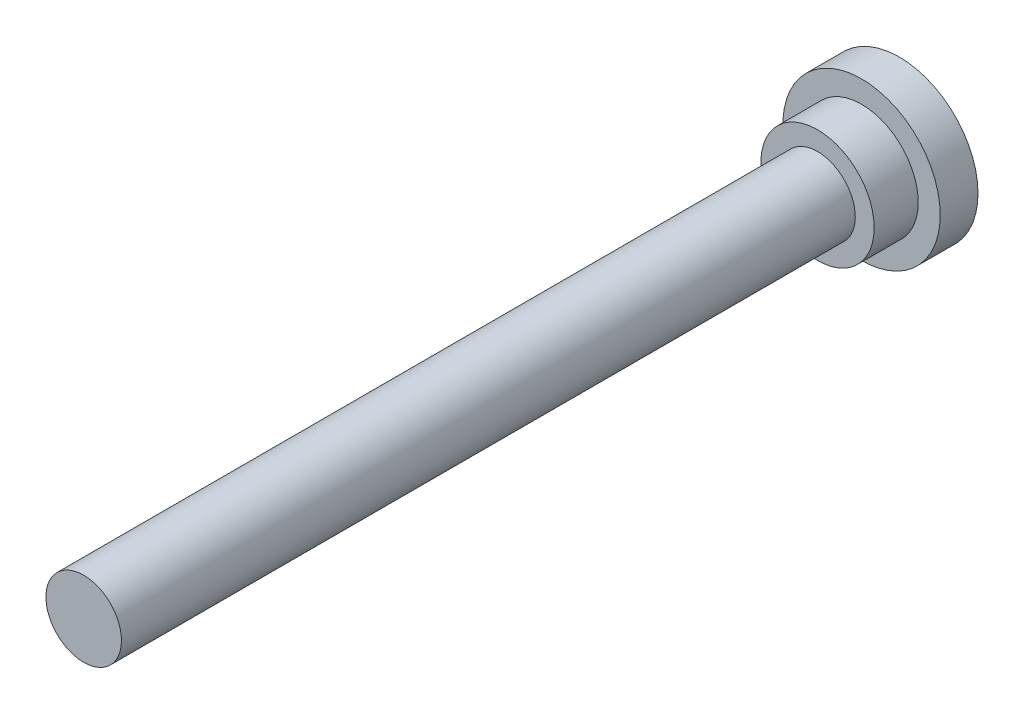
ISO-10303-21;
HEADER;
FILE_DESCRIPTION(('STEP AP214'),'2;1');
FILE_NAME('part.step','',(''),(''),'','','');
FILE_SCHEMA(('AUTOMOTIVE_DESIGN { 1 0 10303 214 1 1 1 1 }'));
ENDSEC;
DATA;
#1=APPLICATION_CONTEXT('core data for automotive mechanical design processes');
#2=APPLICATION_PROTOCOL_DEFINITION('international standard','automotive_design',2000,#1);
#3=PRODUCT_CONTEXT('',#1,'mechanical');
#4=PRODUCT('Part','Part','',(#3));
#5=PRODUCT_RELATED_PRODUCT_CATEGORY('part','',(#4));
#6=PRODUCT_DEFINITION_FORMATION('','',#4);
#7=PRODUCT_DEFINITION_CONTEXT('part definition',#1,'design');
#8=PRODUCT_DEFINITION('design','',#6,#7);
#9=PRODUCT_DEFINITION_SHAPE('','',#8);
#10=(LENGTH_UNIT() NAMED_UNIT(*) SI_UNIT(.MILLI.,.METRE.));
#11=(NAMED_UNIT(*) PLANE_ANGLE_UNIT() SI_UNIT($,.RADIAN.));
#12=(NAMED_UNIT(*) SI_UNIT($,.STERADIAN.) SOLID_ANGLE_UNIT());
#13=UNCERTAINTY_MEASURE_WITH_UNIT(LENGTH_MEASURE(1.E-05),#10,'distance_accuracy_value','');
#14=(GEOMETRIC_REPRESENTATION_CONTEXT(3) GLOBAL_UNCERTAINTY_ASSIGNED_CONTEXT((#13)) GLOBAL_UNIT_ASSIGNED_CONTEXT((#10,
#11,#12)) REPRESENTATION_CONTEXT('',''));
#15=CARTESIAN_POINT('',(0.,0.,0.));
#16=DIRECTION('',(0.,0.,1.));
#17=DIRECTION('',(1.,0.,0.));
#18=AXIS2_PLACEMENT_3D('',#15,#16,#17);
#19=CARTESIAN_POINT('',(0.,0.,129.6));
#20=DIRECTION('',(0.,0.,1.));
#21=DIRECTION('',(1.,0.,0.));
#22=AXIS2_PLACEMENT_3D('',#19,#20,#21);
#23=PLANE('',#22);
#24=CARTESIAN_POINT('',(0.,0.,129.6));
#25=DIRECTION('',(0.,0.,1.));
#26=DIRECTION('',(1.,0.,0.));
#27=AXIS2_PLACEMENT_3D('',#24,#25,#26);
#28=CIRCLE('',#27,6.);
#29=CARTESIAN_POINT('',(6.,0.,129.6));
#30=VERTEX_POINT('',#29);
#31=EDGE_CURVE('E8',#30,#30,#28,.T.);
#32=ORIENTED_EDGE('',*,*,#31,.T.);
#33=EDGE_LOOP('',(#32));
#34=FACE_BOUND('',#33,.T.);
#35=ADVANCED_FACE('F12',(#34),#23,.T.);
#36=CARTESIAN_POINT('',(0.,0.,30.));
#37=DIRECTION('',(0.,0.,1.));
#38=DIRECTION('',(1.,0.,0.));
#39=AXIS2_PLACEMENT_3D('',#36,#37,#38);
#40=CYLINDRICAL_SURFACE('',#39,6.);
#41=CARTESIAN_POINT('',(0.,0.,13.));
#42=DIRECTION('',(0.,0.,1.));
#43=DIRECTION('',(1.,0.,0.));
#44=AXIS2_PLACEMENT_3D('',#41,#42,#43);
#45=CIRCLE('',#44,6.);
#46=CARTESIAN_POINT('',(6.,0.,13.));
#47=VERTEX_POINT('',#46);
#48=EDGE_CURVE('E18',#47,#47,#45,.T.);
#49=ORIENTED_EDGE('',*,*,#48,.T.);
#50=EDGE_LOOP('',(#49));
#51=FACE_BOUND('',#50,.T.);
#52=ORIENTED_EDGE('',*,*,#31,.F.);
#53=EDGE_LOOP('',(#52));
#54=FACE_BOUND('',#53,.T.);
#55=ADVANCED_FACE('F52',(#51,#54),#40,.T.);
#56=CARTESIAN_POINT('',(-6.,0.,13.));
#57=DIRECTION('',(0.,0.,1.));
#58=DIRECTION('',(1.,0.,0.));
#59=AXIS2_PLACEMENT_3D('',#56,#57,#58);
#60=PLANE('',#59);
#61=CARTESIAN_POINT('',(0.,0.,13.));
#62=DIRECTION('',(0.,0.,1.));
#63=DIRECTION('',(1.,0.,0.));
#64=AXIS2_PLACEMENT_3D('',#61,#62,#63);
#65=CIRCLE('',#64,9.);
#66=CARTESIAN_POINT('',(9.,0.,13.));
#67=VERTEX_POINT('',#66);
#68=EDGE_CURVE('E22',#67,#67,#65,.T.);
#69=ORIENTED_EDGE('',*,*,#68,.T.);
#70=EDGE_LOOP('',(#69));
#71=FACE_BOUND('',#70,.T.);
#72=ORIENTED_EDGE('',*,*,#48,.F.);
#73=EDGE_LOOP('',(#72));
#74=FACE_BOUND('',#73,.T.);
#75=ADVANCED_FACE('F57',(#71,#74),#60,.T.);
#76=CARTESIAN_POINT('',(0.,0.,30.));
#77=DIRECTION('',(0.,0.,1.));
#78=DIRECTION('',(1.,0.,0.));
#79=AXIS2_PLACEMENT_3D('',#76,#77,#78);
#80=CYLINDRICAL_SURFACE('',#79,9.);
#81=CARTESIAN_POINT('',(0.,0.,6.));
#82=DIRECTION('',(0.,0.,1.));
#83=DIRECTION('',(1.,0.,0.));
#84=AXIS2_PLACEMENT_3D('',#81,#82,#83);
#85=CIRCLE('',#84,9.);
#86=CARTESIAN_POINT('',(9.,0.,6.));
#87=VERTEX_POINT('',#86);
#88=EDGE_CURVE('E26',#87,#87,#85,.T.);
#89=ORIENTED_EDGE('',*,*,#88,.T.);
#90=EDGE_LOOP('',(#89));
#91=FACE_BOUND('',#90,.T.);
#92=ORIENTED_EDGE('',*,*,#68,.F.);
#93=EDGE_LOOP('',(#92));
#94=FACE_BOUND('',#93,.T.);
#95=ADVANCED_FACE('F62',(#91,#94),#80,.T.);
#96=CARTESIAN_POINT('',(-9.,0.,6.));
#97=DIRECTION('',(0.,0.,1.));
#98=DIRECTION('',(1.,0.,0.));
#99=AXIS2_PLACEMENT_3D('',#96,#97,#98);
#100=PLANE('',#99);
#101=CARTESIAN_POINT('',(0.,0.,6.));
#102=DIRECTION('',(0.,0.,1.));
#103=DIRECTION('',(1.,0.,0.));
#104=AXIS2_PLACEMENT_3D('',#101,#102,#103);
#105=CIRCLE('',#104,12.5);
#106=CARTESIAN_POINT('',(12.5,0.,6.));
#107=VERTEX_POINT('',#106);
#108=EDGE_CURVE('E31',#107,#107,#105,.T.);
#109=ORIENTED_EDGE('',*,*,#108,.T.);
#110=EDGE_LOOP('',(#109));
#111=FACE_BOUND('',#110,.T.);
#112=ORIENTED_EDGE('',*,*,#88,.F.);
#113=EDGE_LOOP('',(#112));
#114=FACE_BOUND('',#113,.T.);
#115=ADVANCED_FACE('F49',(#111,#114),#100,.T.);
#116=CARTESIAN_POINT('',(0.,0.,30.));
#117=DIRECTION('',(0.,0.,1.));
#118=DIRECTION('',(1.,0.,0.));
#119=AXIS2_PLACEMENT_3D('',#116,#117,#118);
#120=CYLINDRICAL_SURFACE('',#119,12.5);
#121=CARTESIAN_POINT('',(0.,0.,0.));
#122=DIRECTION('',(0.,0.,1.));
#123=DIRECTION('',(1.,0.,0.));
#124=AXIS2_PLACEMENT_3D('',#121,#122,#123);
#125=CIRCLE('',#124,12.5);
#126=CARTESIAN_POINT('',(12.5,0.,0.));
#127=VERTEX_POINT('',#126);
#128=EDGE_CURVE('E34',#127,#127,#125,.T.);
#129=ORIENTED_EDGE('',*,*,#128,.T.);
#130=EDGE_LOOP('',(#129));
#131=FACE_BOUND('',#130,.T.);
#132=ORIENTED_EDGE('',*,*,#108,.F.);
#133=EDGE_LOOP('',(#132));
#134=FACE_BOUND('',#133,.T.);
#135=ADVANCED_FACE('F38',(#131,#134),#120,.T.);
#136=CARTESIAN_POINT('',(-12.5,0.,0.));
#137=DIRECTION('',(0.,0.,-1.));
#138=DIRECTION('',(-1.,0.,0.));
#139=AXIS2_PLACEMENT_3D('',#136,#137,#138);
#140=PLANE('',#139);
#141=ORIENTED_EDGE('',*,*,#128,.F.);
#142=EDGE_LOOP('',(#141));
#143=FACE_BOUND('',#142,.T.);
#144=ADVANCED_FACE('F41',(#143),#140,.T.);
#145=CLOSED_SHELL('',(#35,#55,#75,#95,#115,#135,#144));
#146=MANIFOLD_SOLID_BREP('B1',#145);
#147=ADVANCED_BREP_SHAPE_REPRESENTATION('',(#18,#146),#14);
#148=SHAPE_DEFINITION_REPRESENTATION(#9,#147);
ENDSEC;
END-ISO-10303-21;
